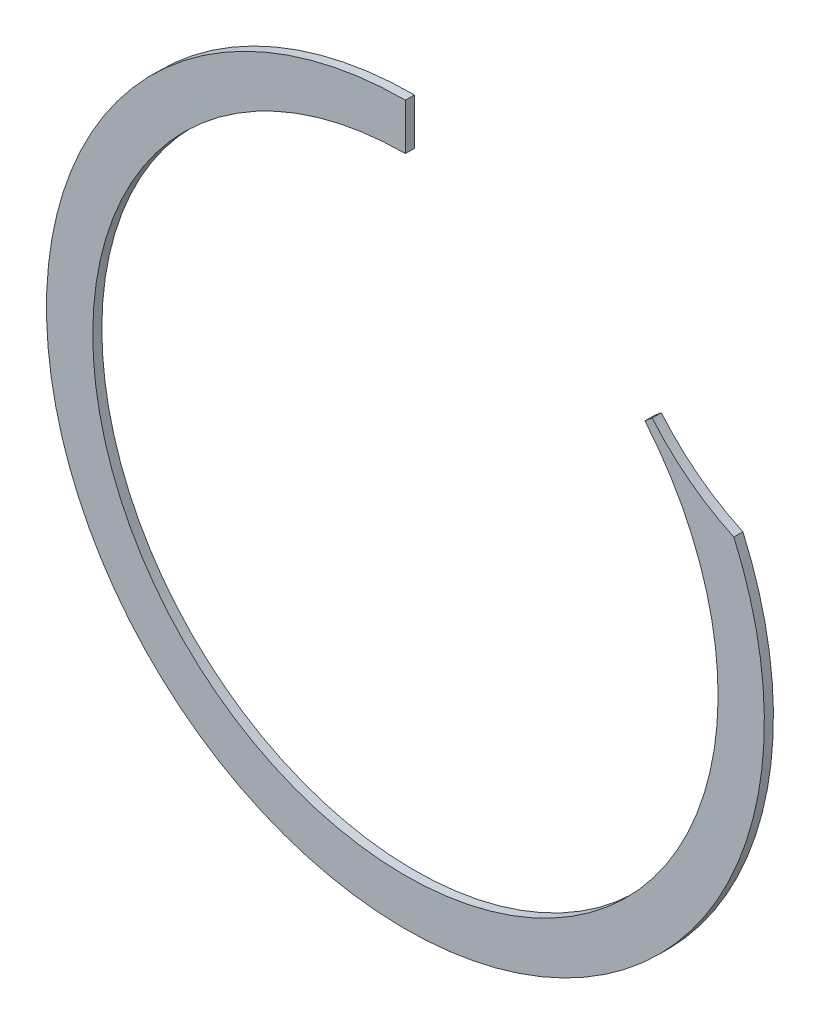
ISO-10303-21;
HEADER;
FILE_DESCRIPTION(('STEP AP214'),'2;1');
FILE_NAME('part.step','',(''),(''),'','','');
FILE_SCHEMA(('AUTOMOTIVE_DESIGN { 1 0 10303 214 1 1 1 1 }'));
ENDSEC;
DATA;
#1=APPLICATION_CONTEXT('core data for automotive mechanical design processes');
#2=APPLICATION_PROTOCOL_DEFINITION('international standard','automotive_design',2000,#1);
#3=PRODUCT_CONTEXT('',#1,'mechanical');
#4=PRODUCT('Part','Part','',(#3));
#5=PRODUCT_RELATED_PRODUCT_CATEGORY('part','',(#4));
#6=PRODUCT_DEFINITION_FORMATION('','',#4);
#7=PRODUCT_DEFINITION_CONTEXT('part definition',#1,'design');
#8=PRODUCT_DEFINITION('design','',#6,#7);
#9=PRODUCT_DEFINITION_SHAPE('','',#8);
#10=(LENGTH_UNIT() NAMED_UNIT(*) SI_UNIT(.MILLI.,.METRE.));
#11=(NAMED_UNIT(*) PLANE_ANGLE_UNIT() SI_UNIT($,.RADIAN.));
#12=(NAMED_UNIT(*) SI_UNIT($,.STERADIAN.) SOLID_ANGLE_UNIT());
#13=UNCERTAINTY_MEASURE_WITH_UNIT(LENGTH_MEASURE(1.E-05),#10,'distance_accuracy_value','');
#14=(GEOMETRIC_REPRESENTATION_CONTEXT(3) GLOBAL_UNCERTAINTY_ASSIGNED_CONTEXT((#13)) GLOBAL_UNIT_ASSIGNED_CONTEXT((#10,
#11,#12)) REPRESENTATION_CONTEXT('',''));
#15=CARTESIAN_POINT('',(0.,0.,0.));
#16=DIRECTION('',(0.,0.,1.));
#17=DIRECTION('',(1.,0.,0.));
#18=AXIS2_PLACEMENT_3D('',#15,#16,#17);
#19=CARTESIAN_POINT('',(0.,0.,0.7874));
#20=DIRECTION('',(0.,0.,1.));
#21=DIRECTION('',(1.,0.,0.));
#22=AXIS2_PLACEMENT_3D('',#19,#20,#21);
#23=PLANE('',#22);
#24=CARTESIAN_POINT('',(0.,0.,0.7874));
#25=DIRECTION('',(0.,0.,1.));
#26=DIRECTION('',(1.,0.,0.));
#27=AXIS2_PLACEMENT_3D('',#24,#25,#26);
#28=CIRCLE('',#27,27.1145);
#29=CARTESIAN_POINT('',(0.,27.1145,0.7874));
#30=VERTEX_POINT('',#29);
#31=CARTESIAN_POINT('',(20.7709120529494,17.4288646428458,0.7874));
#32=VERTEX_POINT('',#31);
#33=EDGE_CURVE('E107',#30,#32,#28,.T.);
#34=ORIENTED_EDGE('',*,*,#33,.F.);
#35=DIRECTION('',(0.,-1.,0.));
#36=VECTOR('',#35,1.);
#37=CARTESIAN_POINT('',(0.,0.,0.7874));
#38=LINE('',#37,#36);
#39=CARTESIAN_POINT('',(0.,31.1277,0.7874));
#40=VERTEX_POINT('',#39);
#41=EDGE_CURVE('E53',#40,#30,#38,.T.);
#42=ORIENTED_EDGE('',*,*,#41,.F.);
#43=CARTESIAN_POINT('',(0.,0.,0.7874));
#44=DIRECTION('',(0.,0.,1.));
#45=DIRECTION('',(1.,0.,0.));
#46=AXIS2_PLACEMENT_3D('',#43,#44,#45);
#47=CIRCLE('',#46,31.1277);
#48=CARTESIAN_POINT('',(28.4819568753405,12.5583374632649,0.7874));
#49=VERTEX_POINT('',#48);
#50=EDGE_CURVE('E112',#40,#49,#47,.T.);
#51=ORIENTED_EDGE('',*,*,#50,.T.);
#52=CARTESIAN_POINT('',(36.9693048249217,31.0209300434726,0.7874));
#53=DIRECTION('',(0.,0.,1.));
#54=DIRECTION('',(1.,0.,0.));
#55=AXIS2_PLACEMENT_3D('',#52,#53,#54);
#56=CIRCLE('',#55,20.32);
#57=CARTESIAN_POINT('',(21.4032817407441,17.959485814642,0.7874));
#58=VERTEX_POINT('',#57);
#59=EDGE_CURVE('E102',#58,#49,#56,.T.);
#60=ORIENTED_EDGE('',*,*,#59,.F.);
#61=DIRECTION('',(0.766044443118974,0.642787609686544,0.));
#62=VECTOR('',#61,1.);
#63=CARTESIAN_POINT('',(21.4032817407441,17.959485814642,0.7874));
#64=LINE('',#63,#62);
#65=EDGE_CURVE('E78',#32,#58,#64,.T.);
#66=ORIENTED_EDGE('',*,*,#65,.F.);
#67=EDGE_LOOP('',(#34,#42,#51,#60,#66));
#68=FACE_BOUND('',#67,.T.);
#69=ADVANCED_FACE('F30',(#68),#23,.T.);
#70=CARTESIAN_POINT('',(0.,0.,0.));
#71=DIRECTION('',(0.,0.,1.));
#72=DIRECTION('',(1.,0.,0.));
#73=AXIS2_PLACEMENT_3D('',#70,#71,#72);
#74=PLANE('',#73);
#75=DIRECTION('',(0.,-1.,0.));
#76=VECTOR('',#75,1.);
#77=CARTESIAN_POINT('',(0.,0.,0.));
#78=LINE('',#77,#76);
#79=CARTESIAN_POINT('',(0.,31.1277,0.));
#80=VERTEX_POINT('',#79);
#81=CARTESIAN_POINT('',(0.,27.1145,0.));
#82=VERTEX_POINT('',#81);
#83=EDGE_CURVE('E96',#80,#82,#78,.T.);
#84=ORIENTED_EDGE('',*,*,#83,.T.);
#85=CARTESIAN_POINT('',(0.,0.,0.));
#86=DIRECTION('',(0.,0.,1.));
#87=DIRECTION('',(1.,0.,0.));
#88=AXIS2_PLACEMENT_3D('',#85,#86,#87);
#89=CIRCLE('',#88,27.1145);
#90=CARTESIAN_POINT('',(20.7709120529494,17.4288646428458,0.));
#91=VERTEX_POINT('',#90);
#92=EDGE_CURVE('E81',#82,#91,#89,.T.);
#93=ORIENTED_EDGE('',*,*,#92,.T.);
#94=DIRECTION('',(0.766044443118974,0.642787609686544,0.));
#95=VECTOR('',#94,1.);
#96=CARTESIAN_POINT('',(21.4032817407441,17.959485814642,0.));
#97=LINE('',#96,#95);
#98=CARTESIAN_POINT('',(21.4032817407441,17.959485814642,0.));
#99=VERTEX_POINT('',#98);
#100=EDGE_CURVE('E45',#91,#99,#97,.T.);
#101=ORIENTED_EDGE('',*,*,#100,.T.);
#102=CARTESIAN_POINT('',(36.9693048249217,31.0209300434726,0.));
#103=DIRECTION('',(0.,0.,1.));
#104=DIRECTION('',(1.,0.,0.));
#105=AXIS2_PLACEMENT_3D('',#102,#103,#104);
#106=CIRCLE('',#105,20.32);
#107=CARTESIAN_POINT('',(28.4819568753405,12.5583374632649,0.));
#108=VERTEX_POINT('',#107);
#109=EDGE_CURVE('E85',#99,#108,#106,.T.);
#110=ORIENTED_EDGE('',*,*,#109,.T.);
#111=CARTESIAN_POINT('',(0.,0.,0.));
#112=DIRECTION('',(0.,0.,1.));
#113=DIRECTION('',(1.,0.,0.));
#114=AXIS2_PLACEMENT_3D('',#111,#112,#113);
#115=CIRCLE('',#114,31.1277);
#116=EDGE_CURVE('E110',#80,#108,#115,.T.);
#117=ORIENTED_EDGE('',*,*,#116,.F.);
#118=EDGE_LOOP('',(#84,#93,#101,#110,#117));
#119=FACE_BOUND('',#118,.T.);
#120=ADVANCED_FACE('F94',(#119),#74,.F.);
#121=CARTESIAN_POINT('',(0.,0.,0.7874));
#122=DIRECTION('',(0.,0.,-1.));
#123=DIRECTION('',(-1.,0.,0.));
#124=AXIS2_PLACEMENT_3D('',#121,#122,#123);
#125=CYLINDRICAL_SURFACE('',#124,31.1277);
#126=DIRECTION('',(0.,0.,-1.));
#127=VECTOR('',#126,1.);
#128=CARTESIAN_POINT('',(28.4819568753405,12.5583374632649,0.3937));
#129=LINE('',#128,#127);
#130=EDGE_CURVE('E11',#49,#108,#129,.T.);
#131=ORIENTED_EDGE('',*,*,#130,.F.);
#132=ORIENTED_EDGE('',*,*,#50,.F.);
#133=DIRECTION('',(0.,0.,-1.));
#134=VECTOR('',#133,1.);
#135=CARTESIAN_POINT('',(0.,31.1277,0.7874));
#136=LINE('',#135,#134);
#137=EDGE_CURVE('E82',#40,#80,#136,.T.);
#138=ORIENTED_EDGE('',*,*,#137,.T.);
#139=ORIENTED_EDGE('',*,*,#116,.T.);
#140=EDGE_LOOP('',(#131,#132,#138,#139));
#141=FACE_BOUND('',#140,.T.);
#142=ADVANCED_FACE('F32',(#141),#125,.T.);
#143=CARTESIAN_POINT('',(0.,0.,0.7874));
#144=DIRECTION('',(0.,0.,-1.));
#145=DIRECTION('',(-1.,0.,0.));
#146=AXIS2_PLACEMENT_3D('',#143,#144,#145);
#147=CYLINDRICAL_SURFACE('',#146,27.1145);
#148=ORIENTED_EDGE('',*,*,#92,.F.);
#149=DIRECTION('',(0.,0.,-1.));
#150=VECTOR('',#149,1.);
#151=CARTESIAN_POINT('',(0.,27.1145,0.7874));
#152=LINE('',#151,#150);
#153=EDGE_CURVE('E38',#82,#30,#152,.F.);
#154=ORIENTED_EDGE('',*,*,#153,.T.);
#155=ORIENTED_EDGE('',*,*,#33,.T.);
#156=DIRECTION('',(0.,0.,-1.));
#157=VECTOR('',#156,1.);
#158=CARTESIAN_POINT('',(20.7709120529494,17.4288646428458,0.7874));
#159=LINE('',#158,#157);
#160=EDGE_CURVE('E115',#32,#91,#159,.T.);
#161=ORIENTED_EDGE('',*,*,#160,.T.);
#162=EDGE_LOOP('',(#148,#154,#155,#161));
#163=FACE_BOUND('',#162,.T.);
#164=ADVANCED_FACE('F118',(#163),#147,.F.);
#165=CARTESIAN_POINT('',(21.4032817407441,17.959485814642,0.7874));
#166=DIRECTION('',(-0.642787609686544,0.766044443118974,0.));
#167=DIRECTION('',(-0.766044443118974,-0.642787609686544,0.));
#168=AXIS2_PLACEMENT_3D('',#165,#166,#167);
#169=PLANE('',#168);
#170=ORIENTED_EDGE('',*,*,#65,.T.);
#171=DIRECTION('',(0.,0.,-1.));
#172=VECTOR('',#171,1.);
#173=CARTESIAN_POINT('',(21.4032817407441,17.959485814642,0.7874));
#174=LINE('',#173,#172);
#175=EDGE_CURVE('E74',#58,#99,#174,.T.);
#176=ORIENTED_EDGE('',*,*,#175,.T.);
#177=ORIENTED_EDGE('',*,*,#100,.F.);
#178=ORIENTED_EDGE('',*,*,#160,.F.);
#179=EDGE_LOOP('',(#170,#176,#177,#178));
#180=FACE_BOUND('',#179,.T.);
#181=ADVANCED_FACE('F76',(#180),#169,.T.);
#182=CARTESIAN_POINT('',(36.9693048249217,31.0209300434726,0.7874));
#183=DIRECTION('',(0.,0.,-1.));
#184=DIRECTION('',(-1.,0.,0.));
#185=AXIS2_PLACEMENT_3D('',#182,#183,#184);
#186=CYLINDRICAL_SURFACE('',#185,20.32);
#187=ORIENTED_EDGE('',*,*,#130,.T.);
#188=ORIENTED_EDGE('',*,*,#109,.F.);
#189=ORIENTED_EDGE('',*,*,#175,.F.);
#190=ORIENTED_EDGE('',*,*,#59,.T.);
#191=EDGE_LOOP('',(#187,#188,#189,#190));
#192=FACE_BOUND('',#191,.T.);
#193=ADVANCED_FACE('F86',(#192),#186,.F.);
#194=CARTESIAN_POINT('',(0.,0.,0.7874));
#195=DIRECTION('',(1.,0.,0.));
#196=DIRECTION('',(0.,0.,-1.));
#197=AXIS2_PLACEMENT_3D('',#194,#195,#196);
#198=PLANE('',#197);
#199=ORIENTED_EDGE('',*,*,#83,.F.);
#200=ORIENTED_EDGE('',*,*,#137,.F.);
#201=ORIENTED_EDGE('',*,*,#41,.T.);
#202=ORIENTED_EDGE('',*,*,#153,.F.);
#203=EDGE_LOOP('',(#199,#200,#201,#202));
#204=FACE_BOUND('',#203,.T.);
#205=ADVANCED_FACE('F122',(#204),#198,.T.);
#206=CLOSED_SHELL('',(#69,#120,#142,#164,#181,#193,#205));
#207=MANIFOLD_SOLID_BREP('B2',#206);
#208=ADVANCED_BREP_SHAPE_REPRESENTATION('',(#18,#207),#14);
#209=SHAPE_DEFINITION_REPRESENTATION(#9,#208);
ENDSEC;
END-ISO-10303-21;
